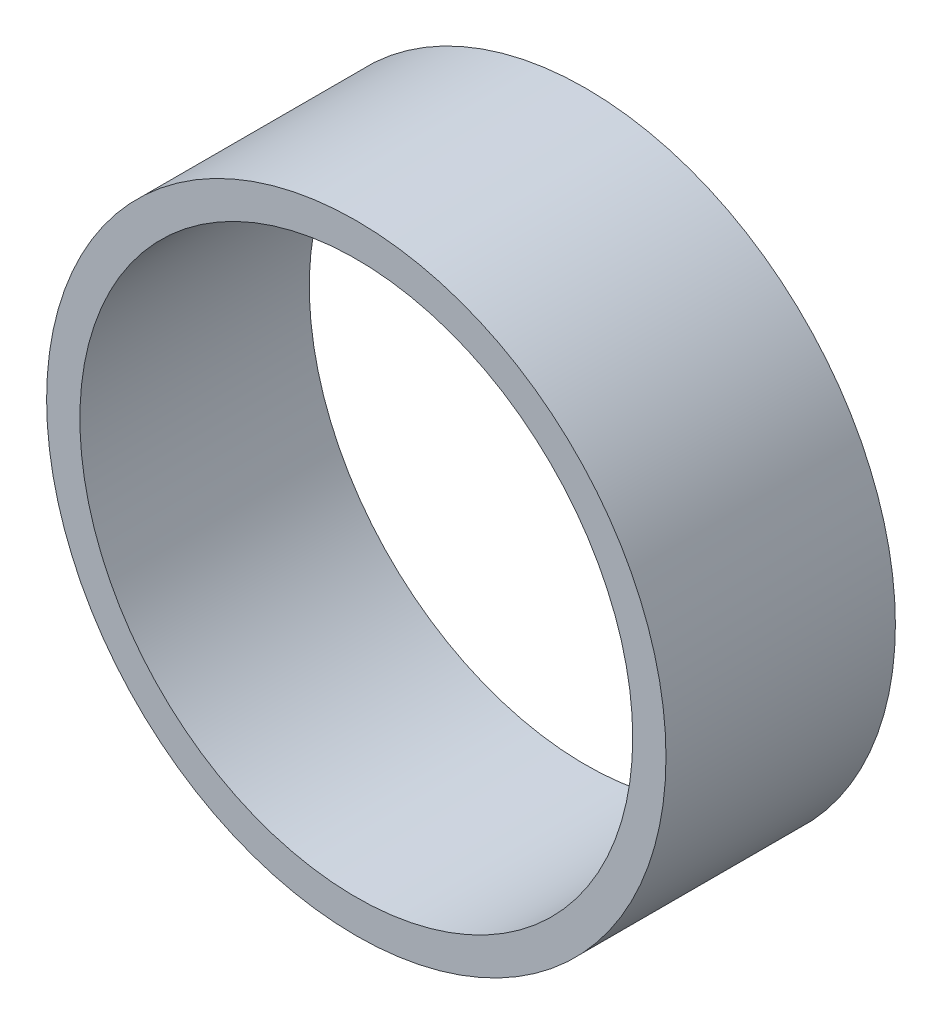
from build123d import *

# Parameters (mm, degrees)
ESQUISSE1_R      = 27
ESQUISSE1_R_2    = 24.1
EXTRUSION1_DEPTH = 20


with BuildPart() as part:
    # Esquisse1 → Extrusion1 (new body)
    with BuildSketch(Plane.XY):
        Circle(ESQUISSE1_R)
        Circle(ESQUISSE1_R_2, mode=Mode.SUBTRACT)
    extrude(amount=EXTRUSION1_DEPTH)


solid = part.part
